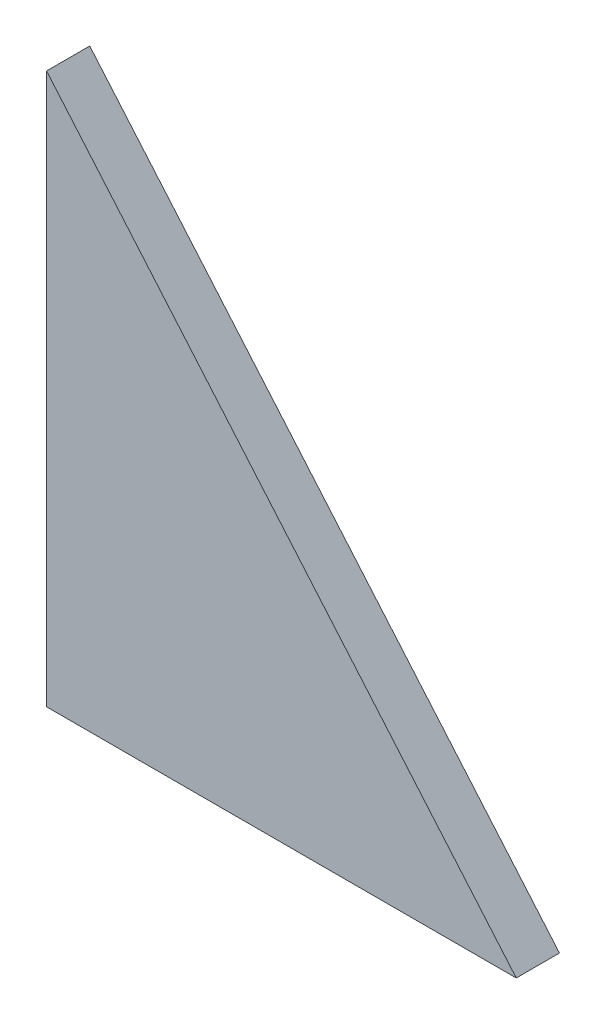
ISO-10303-21;
HEADER;
FILE_DESCRIPTION(('STEP AP214'),'2;1');
FILE_NAME('part.step','',(''),(''),'','','');
FILE_SCHEMA(('AUTOMOTIVE_DESIGN { 1 0 10303 214 1 1 1 1 }'));
ENDSEC;
DATA;
#1=APPLICATION_CONTEXT('core data for automotive mechanical design processes');
#2=APPLICATION_PROTOCOL_DEFINITION('international standard','automotive_design',2000,#1);
#3=PRODUCT_CONTEXT('',#1,'mechanical');
#4=PRODUCT('Part','Part','',(#3));
#5=PRODUCT_RELATED_PRODUCT_CATEGORY('part','',(#4));
#6=PRODUCT_DEFINITION_FORMATION('','',#4);
#7=PRODUCT_DEFINITION_CONTEXT('part definition',#1,'design');
#8=PRODUCT_DEFINITION('design','',#6,#7);
#9=PRODUCT_DEFINITION_SHAPE('','',#8);
#10=(LENGTH_UNIT() NAMED_UNIT(*) SI_UNIT(.MILLI.,.METRE.));
#11=(NAMED_UNIT(*) PLANE_ANGLE_UNIT() SI_UNIT($,.RADIAN.));
#12=(NAMED_UNIT(*) SI_UNIT($,.STERADIAN.) SOLID_ANGLE_UNIT());
#13=UNCERTAINTY_MEASURE_WITH_UNIT(LENGTH_MEASURE(1.E-05),#10,'distance_accuracy_value','');
#14=(GEOMETRIC_REPRESENTATION_CONTEXT(3) GLOBAL_UNCERTAINTY_ASSIGNED_CONTEXT((#13)) GLOBAL_UNIT_ASSIGNED_CONTEXT((#10,
#11,#12)) REPRESENTATION_CONTEXT('',''));
#15=CARTESIAN_POINT('',(0.,0.,0.));
#16=DIRECTION('',(0.,0.,1.));
#17=DIRECTION('',(1.,0.,0.));
#18=AXIS2_PLACEMENT_3D('',#15,#16,#17);
#19=CARTESIAN_POINT('',(90.531708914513,74.531708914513,16.));
#20=DIRECTION('',(0.,0.,1.));
#21=DIRECTION('',(1.,0.,0.));
#22=AXIS2_PLACEMENT_3D('',#19,#20,#21);
#23=PLANE('',#22);
#24=DIRECTION('',(1.,0.,0.));
#25=VECTOR('',#24,1.);
#26=CARTESIAN_POINT('',(31.,0.,16.));
#27=LINE('',#26,#25);
#28=CARTESIAN_POINT('',(31.,0.,16.));
#29=VERTEX_POINT('',#28);
#30=CARTESIAN_POINT('',(205.,0.,16.));
#31=VERTEX_POINT('',#30);
#32=EDGE_CURVE('E72',#29,#31,#27,.T.);
#33=ORIENTED_EDGE('',*,*,#32,.T.);
#34=DIRECTION('',(-0.648946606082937,0.760833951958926,0.));
#35=VECTOR('',#34,1.);
#36=CARTESIAN_POINT('',(205.,0.,16.));
#37=LINE('',#36,#35);
#38=CARTESIAN_POINT('',(31.,204.,16.));
#39=VERTEX_POINT('',#38);
#40=EDGE_CURVE('E65',#31,#39,#37,.T.);
#41=ORIENTED_EDGE('',*,*,#40,.T.);
#42=DIRECTION('',(0.,-1.,0.));
#43=VECTOR('',#42,1.);
#44=CARTESIAN_POINT('',(31.,204.,16.));
#45=LINE('',#44,#43);
#46=EDGE_CURVE('E10',#39,#29,#45,.T.);
#47=ORIENTED_EDGE('',*,*,#46,.T.);
#48=EDGE_LOOP('',(#33,#41,#47));
#49=FACE_BOUND('',#48,.T.);
#50=ADVANCED_FACE('F16',(#49),#23,.T.);
#51=CARTESIAN_POINT('',(90.531708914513,74.531708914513,0.));
#52=DIRECTION('',(0.,0.,1.));
#53=DIRECTION('',(1.,0.,0.));
#54=AXIS2_PLACEMENT_3D('',#51,#52,#53);
#55=PLANE('',#54);
#56=DIRECTION('',(0.,-1.,0.));
#57=VECTOR('',#56,1.);
#58=CARTESIAN_POINT('',(31.,204.,0.));
#59=LINE('',#58,#57);
#60=CARTESIAN_POINT('',(31.,204.,0.));
#61=VERTEX_POINT('',#60);
#62=CARTESIAN_POINT('',(31.,0.,0.));
#63=VERTEX_POINT('',#62);
#64=EDGE_CURVE('E24',#61,#63,#59,.T.);
#65=ORIENTED_EDGE('',*,*,#64,.F.);
#66=DIRECTION('',(-0.648946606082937,0.760833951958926,0.));
#67=VECTOR('',#66,1.);
#68=CARTESIAN_POINT('',(205.,0.,0.));
#69=LINE('',#68,#67);
#70=CARTESIAN_POINT('',(205.,0.,0.));
#71=VERTEX_POINT('',#70);
#72=EDGE_CURVE('E74',#71,#61,#69,.T.);
#73=ORIENTED_EDGE('',*,*,#72,.F.);
#74=DIRECTION('',(1.,0.,0.));
#75=VECTOR('',#74,1.);
#76=CARTESIAN_POINT('',(31.,0.,0.));
#77=LINE('',#76,#75);
#78=EDGE_CURVE('E70',#63,#71,#77,.T.);
#79=ORIENTED_EDGE('',*,*,#78,.F.);
#80=EDGE_LOOP('',(#65,#73,#79));
#81=FACE_BOUND('',#80,.T.);
#82=ADVANCED_FACE('F76',(#81),#55,.F.);
#83=CARTESIAN_POINT('',(31.,204.,0.));
#84=DIRECTION('',(1.,0.,0.));
#85=DIRECTION('',(0.,1.,0.));
#86=AXIS2_PLACEMENT_3D('',#83,#84,#85);
#87=PLANE('',#86);
#88=ORIENTED_EDGE('',*,*,#64,.T.);
#89=DIRECTION('',(0.,0.,1.));
#90=VECTOR('',#89,1.);
#91=CARTESIAN_POINT('',(31.,0.,0.));
#92=LINE('',#91,#90);
#93=EDGE_CURVE('E59',#63,#29,#92,.T.);
#94=ORIENTED_EDGE('',*,*,#93,.T.);
#95=ORIENTED_EDGE('',*,*,#46,.F.);
#96=DIRECTION('',(0.,0.,1.));
#97=VECTOR('',#96,1.);
#98=CARTESIAN_POINT('',(31.,204.,0.));
#99=LINE('',#98,#97);
#100=EDGE_CURVE('E62',#61,#39,#99,.T.);
#101=ORIENTED_EDGE('',*,*,#100,.F.);
#102=EDGE_LOOP('',(#88,#94,#95,#101));
#103=FACE_BOUND('',#102,.T.);
#104=ADVANCED_FACE('F58',(#103),#87,.F.);
#105=CARTESIAN_POINT('',(205.,0.,0.));
#106=DIRECTION('',(-0.760833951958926,-0.648946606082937,0.));
#107=DIRECTION('',(-0.648946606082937,0.760833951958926,0.));
#108=AXIS2_PLACEMENT_3D('',#105,#106,#107);
#109=PLANE('',#108);
#110=ORIENTED_EDGE('',*,*,#72,.T.);
#111=ORIENTED_EDGE('',*,*,#100,.T.);
#112=ORIENTED_EDGE('',*,*,#40,.F.);
#113=DIRECTION('',(0.,0.,1.));
#114=VECTOR('',#113,1.);
#115=CARTESIAN_POINT('',(205.,0.,0.));
#116=LINE('',#115,#114);
#117=EDGE_CURVE('E79',#71,#31,#116,.T.);
#118=ORIENTED_EDGE('',*,*,#117,.F.);
#119=EDGE_LOOP('',(#110,#111,#112,#118));
#120=FACE_BOUND('',#119,.T.);
#121=ADVANCED_FACE('F95',(#120),#109,.F.);
#122=CARTESIAN_POINT('',(31.,0.,0.));
#123=DIRECTION('',(0.,1.,0.));
#124=DIRECTION('',(1.,0.,0.));
#125=AXIS2_PLACEMENT_3D('',#122,#123,#124);
#126=PLANE('',#125);
#127=ORIENTED_EDGE('',*,*,#78,.T.);
#128=ORIENTED_EDGE('',*,*,#117,.T.);
#129=ORIENTED_EDGE('',*,*,#32,.F.);
#130=ORIENTED_EDGE('',*,*,#93,.F.);
#131=EDGE_LOOP('',(#127,#128,#129,#130));
#132=FACE_BOUND('',#131,.T.);
#133=ADVANCED_FACE('F68',(#132),#126,.F.);
#134=CLOSED_SHELL('',(#50,#82,#104,#121,#133));
#135=MANIFOLD_SOLID_BREP('B1',#134);
#136=ADVANCED_BREP_SHAPE_REPRESENTATION('',(#18,#135),#14);
#137=SHAPE_DEFINITION_REPRESENTATION(#9,#136);
ENDSEC;
END-ISO-10303-21;
